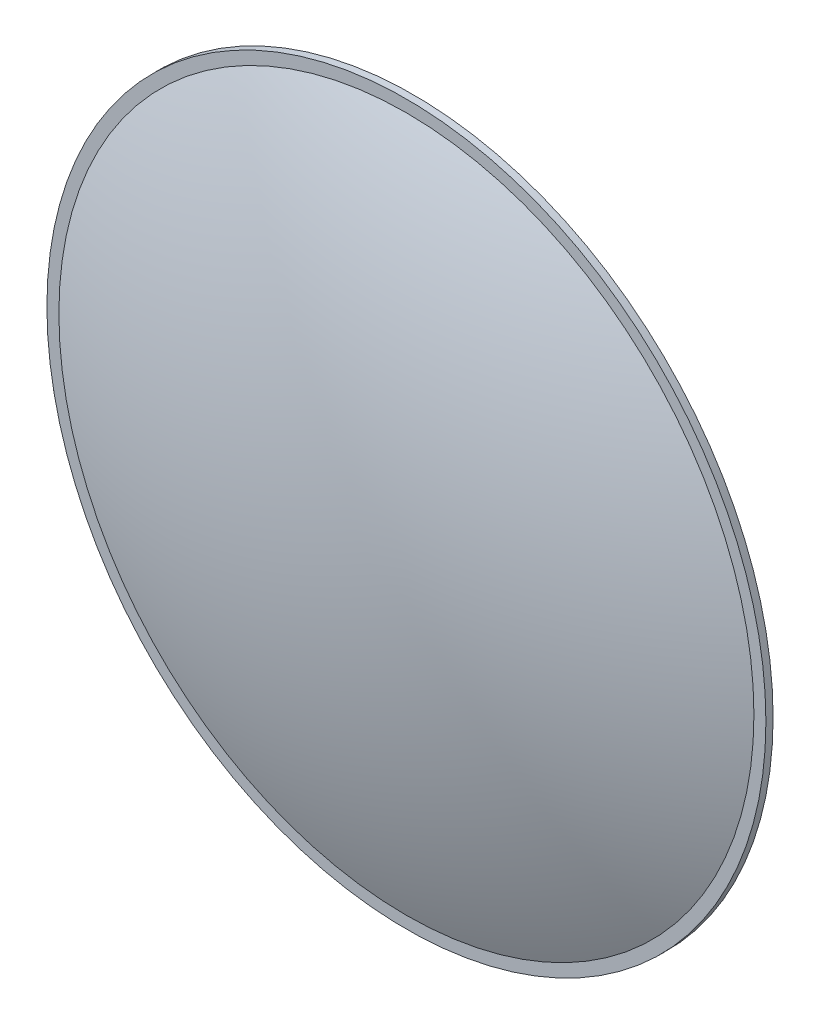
ISO-10303-21;
HEADER;
FILE_DESCRIPTION(('STEP AP214'),'2;1');
FILE_NAME('part.step','',(''),(''),'','','');
FILE_SCHEMA(('AUTOMOTIVE_DESIGN { 1 0 10303 214 1 1 1 1 }'));
ENDSEC;
DATA;
#1=APPLICATION_CONTEXT('core data for automotive mechanical design processes');
#2=APPLICATION_PROTOCOL_DEFINITION('international standard','automotive_design',2000,#1);
#3=PRODUCT_CONTEXT('',#1,'mechanical');
#4=PRODUCT('Part','Part','',(#3));
#5=PRODUCT_RELATED_PRODUCT_CATEGORY('part','',(#4));
#6=PRODUCT_DEFINITION_FORMATION('','',#4);
#7=PRODUCT_DEFINITION_CONTEXT('part definition',#1,'design');
#8=PRODUCT_DEFINITION('design','',#6,#7);
#9=PRODUCT_DEFINITION_SHAPE('','',#8);
#10=(LENGTH_UNIT() NAMED_UNIT(*) SI_UNIT(.MILLI.,.METRE.));
#11=(NAMED_UNIT(*) PLANE_ANGLE_UNIT() SI_UNIT($,.RADIAN.));
#12=(NAMED_UNIT(*) SI_UNIT($,.STERADIAN.) SOLID_ANGLE_UNIT());
#13=UNCERTAINTY_MEASURE_WITH_UNIT(LENGTH_MEASURE(1.E-05),#10,'distance_accuracy_value','');
#14=(GEOMETRIC_REPRESENTATION_CONTEXT(3) GLOBAL_UNCERTAINTY_ASSIGNED_CONTEXT((#13)) GLOBAL_UNIT_ASSIGNED_CONTEXT((#10,
#11,#12)) REPRESENTATION_CONTEXT('',''));
#15=CARTESIAN_POINT('',(0.,0.,0.));
#16=DIRECTION('',(0.,0.,1.));
#17=DIRECTION('',(1.,0.,0.));
#18=AXIS2_PLACEMENT_3D('',#15,#16,#17);
#19=CARTESIAN_POINT('',(0.,0.,0.));
#20=DIRECTION('',(0.,0.,1.));
#21=DIRECTION('',(1.,0.,0.));
#22=AXIS2_PLACEMENT_3D('',#19,#20,#21);
#23=PLANE('',#22);
#24=CARTESIAN_POINT('',(0.,0.,0.));
#25=DIRECTION('',(0.,0.,-1.));
#26=DIRECTION('',(-1.,0.,0.));
#27=AXIS2_PLACEMENT_3D('',#24,#25,#26);
#28=CIRCLE('',#27,144.377976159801);
#29=CARTESIAN_POINT('',(-144.377976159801,0.,0.));
#30=VERTEX_POINT('',#29);
#31=EDGE_CURVE('E47',#30,#30,#28,.F.);
#32=ORIENTED_EDGE('',*,*,#31,.T.);
#33=EDGE_LOOP('',(#32));
#34=FACE_BOUND('',#33,.T.);
#35=CARTESIAN_POINT('',(0.,0.,0.));
#36=DIRECTION('',(0.,0.,-1.));
#37=DIRECTION('',(-1.,0.,0.));
#38=AXIS2_PLACEMENT_3D('',#35,#36,#37);
#39=CIRCLE('',#38,150.);
#40=CARTESIAN_POINT('',(-150.,0.,0.));
#41=VERTEX_POINT('',#40);
#42=EDGE_CURVE('E42',#41,#41,#39,.T.);
#43=ORIENTED_EDGE('',*,*,#42,.T.);
#44=EDGE_LOOP('',(#43));
#45=FACE_BOUND('',#44,.T.);
#46=ADVANCED_FACE('F31',(#34,#45),#23,.F.);
#47=CARTESIAN_POINT('',(0.,0.,3.));
#48=DIRECTION('',(0.,0.,-1.));
#49=DIRECTION('',(-1.,0.,0.));
#50=AXIS2_PLACEMENT_3D('',#47,#48,#49);
#51=CYLINDRICAL_SURFACE('',#50,150.);
#52=CARTESIAN_POINT('',(0.,0.,3.));
#53=DIRECTION('',(0.,0.,-1.));
#54=DIRECTION('',(-1.,0.,0.));
#55=AXIS2_PLACEMENT_3D('',#52,#53,#54);
#56=CIRCLE('',#55,150.);
#57=CARTESIAN_POINT('',(-150.,0.,3.));
#58=VERTEX_POINT('',#57);
#59=EDGE_CURVE('E38',#58,#58,#56,.T.);
#60=ORIENTED_EDGE('',*,*,#59,.T.);
#61=EDGE_LOOP('',(#60));
#62=FACE_BOUND('',#61,.T.);
#63=ORIENTED_EDGE('',*,*,#42,.F.);
#64=EDGE_LOOP('',(#63));
#65=FACE_BOUND('',#64,.T.);
#66=ADVANCED_FACE('F63',(#62,#65),#51,.T.);
#67=CARTESIAN_POINT('',(0.,0.,3.));
#68=DIRECTION('',(0.,0.,-1.));
#69=DIRECTION('',(-1.,0.,0.));
#70=AXIS2_PLACEMENT_3D('',#67,#68,#69);
#71=PLANE('',#70);
#72=CARTESIAN_POINT('',(0.,0.,3.));
#73=DIRECTION('',(0.,0.,-1.));
#74=DIRECTION('',(-1.,0.,0.));
#75=AXIS2_PLACEMENT_3D('',#72,#73,#74);
#76=CIRCLE('',#75,145.);
#77=CARTESIAN_POINT('',(-145.,0.,3.));
#78=VERTEX_POINT('',#77);
#79=EDGE_CURVE('E10',#78,#78,#76,.F.);
#80=ORIENTED_EDGE('',*,*,#79,.F.);
#81=EDGE_LOOP('',(#80));
#82=FACE_BOUND('',#81,.T.);
#83=ORIENTED_EDGE('',*,*,#59,.F.);
#84=EDGE_LOOP('',(#83));
#85=FACE_BOUND('',#84,.T.);
#86=ADVANCED_FACE('F60',(#82,#85),#71,.F.);
#87=CARTESIAN_POINT('',(0.,0.,-332.416666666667));
#88=DIRECTION('',(0.,0.,1.));
#89=DIRECTION('',(1.,0.,0.));
#90=AXIS2_PLACEMENT_3D('',#87,#88,#89);
#91=SPHERICAL_SURFACE('',#90,365.416666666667);
#92=ORIENTED_EDGE('',*,*,#79,.T.);
#93=EDGE_LOOP('',(#92));
#94=FACE_BOUND('',#93,.T.);
#95=ADVANCED_FACE('F33',(#94),#91,.T.);
#96=CARTESIAN_POINT('',(0.,0.,-332.416666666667));
#97=DIRECTION('',(0.,0.,1.));
#98=DIRECTION('',(1.,0.,0.));
#99=AXIS2_PLACEMENT_3D('',#96,#97,#98);
#100=SPHERICAL_SURFACE('',#99,362.416666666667);
#101=ORIENTED_EDGE('',*,*,#31,.F.);
#102=EDGE_LOOP('',(#101));
#103=FACE_BOUND('',#102,.T.);
#104=ADVANCED_FACE('F54',(#103),#100,.F.);
#105=CLOSED_SHELL('',(#46,#66,#86,#95,#104));
#106=MANIFOLD_SOLID_BREP('B2',#105);
#107=ADVANCED_BREP_SHAPE_REPRESENTATION('',(#18,#106),#14);
#108=SHAPE_DEFINITION_REPRESENTATION(#9,#107);
ENDSEC;
END-ISO-10303-21;
